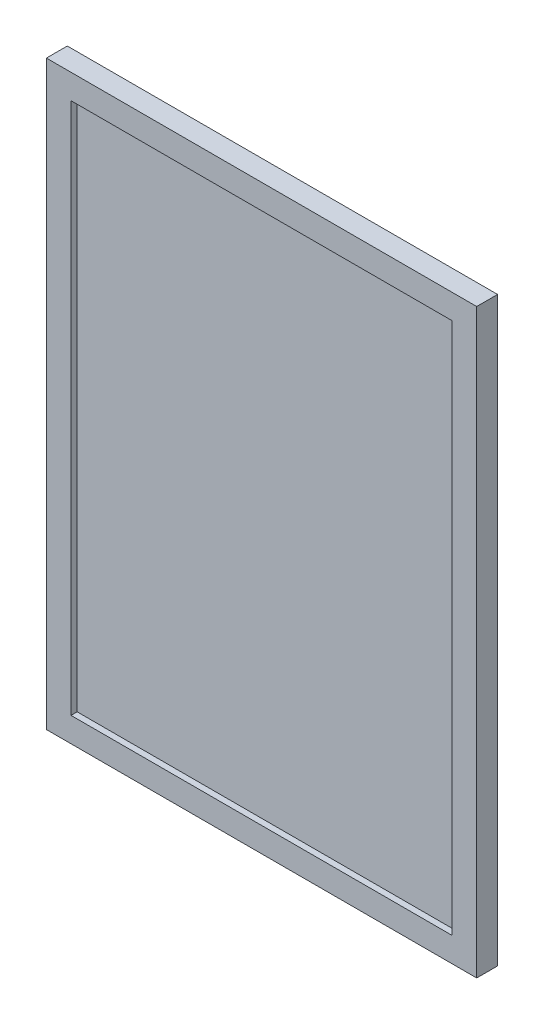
from build123d import *

# Parameters (mm, degrees)
ESQUISSE1_W             = 350
ESQUISSE1_H             = 473
BOSS_EXTRU_1_DEPTH      = 17
ESQUISSE2_W             = 310
ESQUISSE2_H             = 433
ENL_V_MAT_EXTRU_1_DEPTH = 5
ESQUISSE3_W             = 310
ESQUISSE3_H             = 433
ENL_V_MAT_EXTRU_2_DEPTH = 5


with BuildPart() as part:
    # Esquisse1 → Boss.-Extru.1 (new body)
    with BuildSketch(Plane.XY):
        with Locations((175, 236.5)):
            Rectangle(ESQUISSE1_W, ESQUISSE1_H)
    extrude(amount=BOSS_EXTRU_1_DEPTH)

    # Esquisse2 → Enl_v. mat.-Extru.1 (cut)
    with BuildSketch(Plane(origin=(0, 0, 0), x_dir=(-1, 0, 0), z_dir=(0, 0, -1))):
        with Locations((-175, 236.5)):
            Rectangle(ESQUISSE2_W, ESQUISSE2_H)
    extrude(amount=-ENL_V_MAT_EXTRU_1_DEPTH, mode=Mode.SUBTRACT)

    # Esquisse3 → Enl_v. mat.-Extru.2 (cut)
    with BuildSketch(Plane.XY.offset(17)):
        with Locations((175, 236.5)):
            Rectangle(ESQUISSE3_W, ESQUISSE3_H)
    extrude(amount=-ENL_V_MAT_EXTRU_2_DEPTH, mode=Mode.SUBTRACT)


solid = part.part
